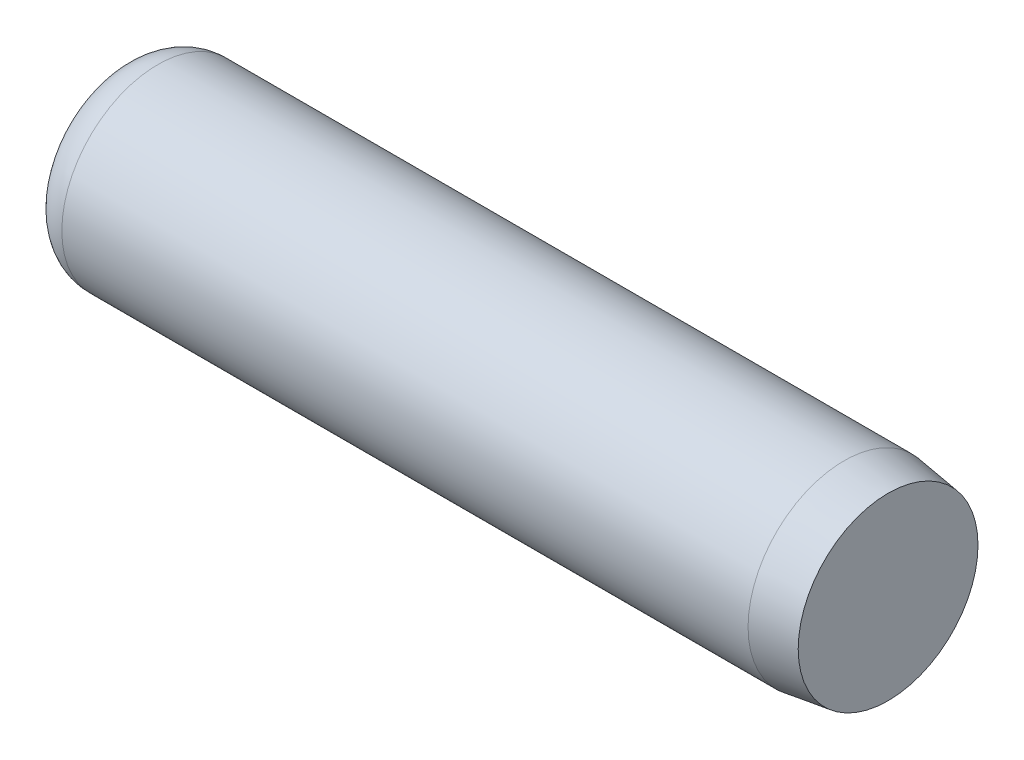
from build123d import *


with BuildPart() as part:
    # Sketch1 → Base-Revolve (revolve)
    with BuildSketch(Plane.XY, mode=Mode.PRIVATE) as base_revolve_sk:
        with BuildLine():
            Line((0, 0), (101.6, 0))
            Line((101.6, 0), (101.6, 11.883290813))
            Line((101.6, 11.883290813), (95.788812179, 12.7))
            Line((95.788812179, 12.7), (5.08, 12.7))
            ThreePointArc((5.08, 12.7), (1.487897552, 11.212102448), (0, 7.62))
            Line((0, 7.62), (0, 0))
        make_face()
    revolve(base_revolve_sk.sketch.rotate(Axis((-6.35, 0, 0), (1, 0, 0)), 90), axis=Axis((-6.35, 0, 0), (1, 0, 0)))


solid = part.part
